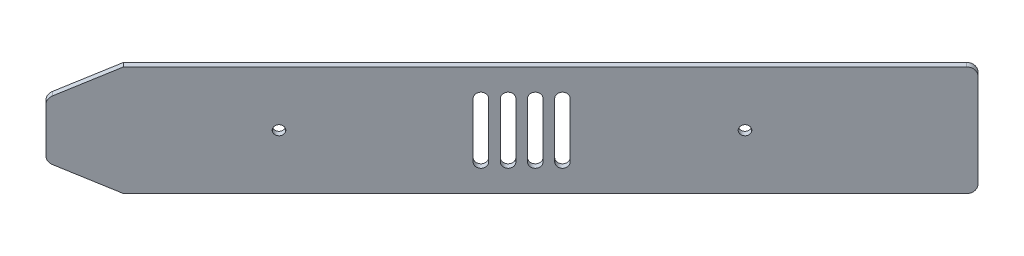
ISO-10303-21;
HEADER;
FILE_DESCRIPTION(('STEP AP214'),'2;1');
FILE_NAME('part.step','',(''),(''),'','','');
FILE_SCHEMA(('AUTOMOTIVE_DESIGN { 1 0 10303 214 1 1 1 1 }'));
ENDSEC;
DATA;
#1=APPLICATION_CONTEXT('core data for automotive mechanical design processes');
#2=APPLICATION_PROTOCOL_DEFINITION('international standard','automotive_design',2000,#1);
#3=PRODUCT_CONTEXT('',#1,'mechanical');
#4=PRODUCT('Part','Part','',(#3));
#5=PRODUCT_RELATED_PRODUCT_CATEGORY('part','',(#4));
#6=PRODUCT_DEFINITION_FORMATION('','',#4);
#7=PRODUCT_DEFINITION_CONTEXT('part definition',#1,'design');
#8=PRODUCT_DEFINITION('design','',#6,#7);
#9=PRODUCT_DEFINITION_SHAPE('','',#8);
#10=(LENGTH_UNIT() NAMED_UNIT(*) SI_UNIT(.MILLI.,.METRE.));
#11=(NAMED_UNIT(*) PLANE_ANGLE_UNIT() SI_UNIT($,.RADIAN.));
#12=(NAMED_UNIT(*) SI_UNIT($,.STERADIAN.) SOLID_ANGLE_UNIT());
#13=UNCERTAINTY_MEASURE_WITH_UNIT(LENGTH_MEASURE(1.E-05),#10,'distance_accuracy_value','');
#14=(GEOMETRIC_REPRESENTATION_CONTEXT(3) GLOBAL_UNCERTAINTY_ASSIGNED_CONTEXT((#13)) GLOBAL_UNIT_ASSIGNED_CONTEXT((#10,
#11,#12)) REPRESENTATION_CONTEXT('',''));
#15=CARTESIAN_POINT('',(0.,0.,0.));
#16=DIRECTION('',(0.,0.,1.));
#17=DIRECTION('',(1.,0.,0.));
#18=AXIS2_PLACEMENT_3D('',#15,#16,#17);
#19=CARTESIAN_POINT('',(26.6287521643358,39.9999999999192,15.8228234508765));
#20=DIRECTION('',(0.,-1.,0.));
#21=DIRECTION('',(-0.707106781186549,0.,-0.707106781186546));
#22=AXIS2_PLACEMENT_3D('',#19,#20,#21);
#23=PLANE('',#22);
#24=DIRECTION('',(-0.707106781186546,0.,0.707106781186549));
#25=VECTOR('',#24,1.);
#26=CARTESIAN_POINT('',(26.6287521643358,39.9999999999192,15.8228234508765));
#27=LINE('',#26,#25);
#28=CARTESIAN_POINT('',(180.070923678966,40.0000000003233,-137.619348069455));
#29=VERTEX_POINT('',#28);
#30=CARTESIAN_POINT('',(26.6287521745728,39.9999999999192,15.8228234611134));
#31=VERTEX_POINT('',#30);
#32=EDGE_CURVE('E218',#29,#31,#27,.T.);
#33=ORIENTED_EDGE('',*,*,#32,.F.);
#34=DIRECTION('',(-0.707106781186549,0.,-0.707106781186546));
#35=VECTOR('',#34,1.);
#36=CARTESIAN_POINT('',(180.070923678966,40.0000000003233,-137.619348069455));
#37=LINE('',#36,#35);
#38=CARTESIAN_POINT('',(178.656710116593,40.0000000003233,-139.033561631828));
#39=VERTEX_POINT('',#38);
#40=EDGE_CURVE('E419',#29,#39,#37,.T.);
#41=ORIENTED_EDGE('',*,*,#40,.T.);
#42=DIRECTION('',(-0.707106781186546,0.,0.707106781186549));
#43=VECTOR('',#42,1.);
#44=CARTESIAN_POINT('',(25.2145386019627,39.9999999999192,14.4086098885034));
#45=LINE('',#44,#43);
#46=CARTESIAN_POINT('',(25.2145386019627,39.9999999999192,14.4086098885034));
#47=VERTEX_POINT('',#46);
#48=EDGE_CURVE('E12',#39,#47,#45,.T.);
#49=ORIENTED_EDGE('',*,*,#48,.T.);
#50=DIRECTION('',(0.707106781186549,0.,0.707106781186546));
#51=VECTOR('',#50,1.);
#52=CARTESIAN_POINT('',(26.6287521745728,39.9999999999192,15.8228234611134));
#53=LINE('',#52,#51);
#54=EDGE_CURVE('E283',#47,#31,#53,.T.);
#55=ORIENTED_EDGE('',*,*,#54,.T.);
#56=EDGE_LOOP('',(#33,#41,#49,#55));
#57=FACE_BOUND('',#56,.T.);
#58=ADVANCED_FACE('F60',(#57),#23,.F.);
#59=CARTESIAN_POINT('',(13.1937233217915,28.1458980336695,26.4294251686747));
#60=DIRECTION('',(0.707106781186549,0.,0.707106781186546));
#61=DIRECTION('',(0.707106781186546,0.,-0.707106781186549));
#62=AXIS2_PLACEMENT_3D('',#59,#60,#61);
#63=PLANE('',#62);
#64=ORIENTED_EDGE('',*,*,#48,.F.);
#65=CARTESIAN_POINT('',(178.656710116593,37.0000000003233,-139.033561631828));
#66=DIRECTION('',(0.707106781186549,0.,0.707106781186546));
#67=DIRECTION('',(-0.707106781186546,0.,0.707106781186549));
#68=AXIS2_PLACEMENT_3D('',#65,#66,#67);
#69=CIRCLE('',#68,3.);
#70=CARTESIAN_POINT('',(180.778030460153,37.0000000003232,-141.154881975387));
#71=VERTEX_POINT('',#70);
#72=EDGE_CURVE('E286',#71,#39,#69,.T.);
#73=ORIENTED_EDGE('',*,*,#72,.F.);
#74=DIRECTION('',(0.,1.,0.));
#75=VECTOR('',#74,1.);
#76=CARTESIAN_POINT('',(180.778030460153,3.00000000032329,-141.154881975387));
#77=LINE('',#76,#75);
#78=CARTESIAN_POINT('',(180.778030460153,3.00000000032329,-141.154881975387));
#79=VERTEX_POINT('',#78);
#80=EDGE_CURVE('E199',#79,#71,#77,.T.);
#81=ORIENTED_EDGE('',*,*,#80,.F.);
#82=CARTESIAN_POINT('',(178.656710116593,3.00000000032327,-139.033561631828));
#83=DIRECTION('',(0.707106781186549,0.,0.707106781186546));
#84=DIRECTION('',(0.707106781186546,0.,-0.707106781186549));
#85=AXIS2_PLACEMENT_3D('',#82,#83,#84);
#86=CIRCLE('',#85,3.);
#87=CARTESIAN_POINT('',(178.656710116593,3.23265769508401E-10,-139.033561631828));
#88=VERTEX_POINT('',#87);
#89=EDGE_CURVE('E425',#88,#79,#86,.T.);
#90=ORIENTED_EDGE('',*,*,#89,.F.);
#91=DIRECTION('',(0.707106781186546,0.,-0.707106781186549));
#92=VECTOR('',#91,1.);
#93=CARTESIAN_POINT('',(25.2145386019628,-8.07687250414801E-11,14.4086098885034));
#94=LINE('',#93,#92);
#95=CARTESIAN_POINT('',(25.2145386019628,-8.07687250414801E-11,14.4086098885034));
#96=VERTEX_POINT('',#95);
#97=EDGE_CURVE('E70',#96,#88,#94,.T.);
#98=ORIENTED_EDGE('',*,*,#97,.F.);
#99=DIRECTION('',(0.632455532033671,-0.447213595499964,-0.632455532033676));
#100=VECTOR('',#99,1.);
#101=CARTESIAN_POINT('',(24.7323192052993,0.340980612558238,14.8908293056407));
#102=LINE('',#101,#100);
#103=CARTESIAN_POINT('',(12.2450400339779,9.17082039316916,27.3781084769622));
#104=VERTEX_POINT('',#103);
#105=EDGE_CURVE('E444',#104,#96,#102,.T.);
#106=ORIENTED_EDGE('',*,*,#105,.F.);
#107=CARTESIAN_POINT('',(13.1937233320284,11.8541019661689,26.4294251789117));
#108=DIRECTION('',(0.707106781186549,0.,0.707106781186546));
#109=DIRECTION('',(-0.707106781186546,0.,0.707106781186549));
#110=AXIS2_PLACEMENT_3D('',#107,#108,#109);
#111=CIRCLE('',#110,3.);
#112=CARTESIAN_POINT('',(11.0724029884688,11.8541019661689,28.5507455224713));
#113=VERTEX_POINT('',#112);
#114=EDGE_CURVE('E256',#113,#104,#111,.T.);
#115=ORIENTED_EDGE('',*,*,#114,.F.);
#116=DIRECTION('',(0.,-1.,0.));
#117=VECTOR('',#116,1.);
#118=CARTESIAN_POINT('',(11.0724029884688,11.8541019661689,28.5507455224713));
#119=LINE('',#118,#117);
#120=CARTESIAN_POINT('',(11.0724029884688,28.1458980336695,28.5507455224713));
#121=VERTEX_POINT('',#120);
#122=EDGE_CURVE('E249',#121,#113,#119,.T.);
#123=ORIENTED_EDGE('',*,*,#122,.F.);
#124=CARTESIAN_POINT('',(13.1937233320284,28.1458980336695,26.4294251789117));
#125=DIRECTION('',(0.707106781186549,0.,0.707106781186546));
#126=DIRECTION('',(0.707106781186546,0.,-0.707106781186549));
#127=AXIS2_PLACEMENT_3D('',#124,#125,#126);
#128=CIRCLE('',#127,3.);
#129=CARTESIAN_POINT('',(12.2450400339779,30.8291796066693,27.3781084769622));
#130=VERTEX_POINT('',#129);
#131=EDGE_CURVE('E254',#130,#121,#128,.T.);
#132=ORIENTED_EDGE('',*,*,#131,.F.);
#133=DIRECTION('',(-0.632455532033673,-0.447213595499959,0.632455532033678));
#134=VECTOR('',#133,1.);
#135=CARTESIAN_POINT('',(25.2145386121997,39.9999999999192,14.4086098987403));
#136=LINE('',#135,#134);
#137=EDGE_CURVE('E447',#47,#130,#136,.T.);
#138=ORIENTED_EDGE('',*,*,#137,.F.);
#139=EDGE_LOOP('',(#64,#73,#81,#90,#98,#106,#115,#123,#132,#138));
#140=FACE_BOUND('',#139,.T.);
#141=CARTESIAN_POINT('',(138.35162358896,20.,-98.7284751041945));
#142=DIRECTION('',(0.707106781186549,0.,0.707106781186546));
#143=DIRECTION('',(0.707106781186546,0.,-0.707106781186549));
#144=AXIS2_PLACEMENT_3D('',#141,#142,#143);
#145=CIRCLE('',#144,1.75000000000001);
#146=CARTESIAN_POINT('',(139.589060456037,20.,-99.9659119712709));
#147=VERTEX_POINT('',#146);
#148=EDGE_CURVE('E290',#147,#147,#145,.T.);
#149=ORIENTED_EDGE('',*,*,#148,.T.);
#150=EDGE_LOOP('',(#149));
#151=FACE_BOUND('',#150,.T.);
#152=CARTESIAN_POINT('',(53.4988098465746,20.,-13.8756613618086));
#153=DIRECTION('',(0.707106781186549,0.,0.707106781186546));
#154=DIRECTION('',(0.707106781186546,0.,-0.707106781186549));
#155=AXIS2_PLACEMENT_3D('',#152,#153,#154);
#156=CIRCLE('',#155,1.75);
#157=CARTESIAN_POINT('',(54.736246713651,20.,-15.1130982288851));
#158=VERTEX_POINT('',#157);
#159=EDGE_CURVE('E287',#158,#158,#156,.T.);
#160=ORIENTED_EDGE('',*,*,#159,.T.);
#161=EDGE_LOOP('',(#160));
#162=FACE_BOUND('',#161,.T.);
#163=DIRECTION('',(0.,-1.,0.));
#164=VECTOR('',#163,1.);
#165=CARTESIAN_POINT('',(106.531818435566,30.,-66.9086699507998));
#166=LINE('',#165,#164);
#167=CARTESIAN_POINT('',(106.531818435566,30.,-66.9086699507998));
#168=VERTEX_POINT('',#167);
#169=CARTESIAN_POINT('',(106.531818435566,10.,-66.9086699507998));
#170=VERTEX_POINT('',#169);
#171=EDGE_CURVE('E384',#168,#170,#166,.T.);
#172=ORIENTED_EDGE('',*,*,#171,.F.);
#173=CARTESIAN_POINT('',(105.117604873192,30.,-65.4944563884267));
#174=DIRECTION('',(-0.707106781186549,0.,-0.707106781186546));
#175=DIRECTION('',(0.707106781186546,0.,-0.707106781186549));
#176=AXIS2_PLACEMENT_3D('',#173,#174,#175);
#177=CIRCLE('',#176,2.);
#178=CARTESIAN_POINT('',(103.703391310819,30.,-64.0802428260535));
#179=VERTEX_POINT('',#178);
#180=EDGE_CURVE('E378',#179,#168,#177,.T.);
#181=ORIENTED_EDGE('',*,*,#180,.F.);
#182=DIRECTION('',(0.,1.,0.));
#183=VECTOR('',#182,1.);
#184=CARTESIAN_POINT('',(103.703391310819,30.,-64.0802428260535));
#185=LINE('',#184,#183);
#186=CARTESIAN_POINT('',(103.703391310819,10.,-64.0802428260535));
#187=VERTEX_POINT('',#186);
#188=EDGE_CURVE('E400',#187,#179,#185,.T.);
#189=ORIENTED_EDGE('',*,*,#188,.F.);
#190=CARTESIAN_POINT('',(105.117604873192,10.,-65.4944563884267));
#191=DIRECTION('',(-0.707106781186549,0.,-0.707106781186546));
#192=DIRECTION('',(0.707106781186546,0.,-0.707106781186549));
#193=AXIS2_PLACEMENT_3D('',#190,#191,#192);
#194=CIRCLE('',#193,2.);
#195=EDGE_CURVE('E392',#170,#187,#194,.T.);
#196=ORIENTED_EDGE('',*,*,#195,.F.);
#197=EDGE_LOOP('',(#172,#181,#189,#196));
#198=FACE_BOUND('',#197,.T.);
#199=DIRECTION('',(0.,-1.,0.));
#200=VECTOR('',#199,1.);
#201=CARTESIAN_POINT('',(101.58207096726,30.,-61.9589224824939));
#202=LINE('',#201,#200);
#203=CARTESIAN_POINT('',(101.58207096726,30.,-61.9589224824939));
#204=VERTEX_POINT('',#203);
#205=CARTESIAN_POINT('',(101.58207096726,10.,-61.9589224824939));
#206=VERTEX_POINT('',#205);
#207=EDGE_CURVE('E355',#204,#206,#202,.T.);
#208=ORIENTED_EDGE('',*,*,#207,.F.);
#209=CARTESIAN_POINT('',(100.167857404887,30.,-60.5447089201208));
#210=DIRECTION('',(-0.707106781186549,0.,-0.707106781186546));
#211=DIRECTION('',(0.707106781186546,0.,-0.707106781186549));
#212=AXIS2_PLACEMENT_3D('',#209,#210,#211);
#213=CIRCLE('',#212,2.);
#214=CARTESIAN_POINT('',(98.7536438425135,30.,-59.1304953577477));
#215=VERTEX_POINT('',#214);
#216=EDGE_CURVE('E349',#215,#204,#213,.T.);
#217=ORIENTED_EDGE('',*,*,#216,.F.);
#218=DIRECTION('',(0.,1.,0.));
#219=VECTOR('',#218,1.);
#220=CARTESIAN_POINT('',(98.7536438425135,30.,-59.1304953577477));
#221=LINE('',#220,#219);
#222=CARTESIAN_POINT('',(98.7536438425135,10.,-59.1304953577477));
#223=VERTEX_POINT('',#222);
#224=EDGE_CURVE('E371',#223,#215,#221,.T.);
#225=ORIENTED_EDGE('',*,*,#224,.F.);
#226=CARTESIAN_POINT('',(100.167857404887,10.,-60.5447089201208));
#227=DIRECTION('',(-0.707106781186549,0.,-0.707106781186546));
#228=DIRECTION('',(0.707106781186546,0.,-0.707106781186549));
#229=AXIS2_PLACEMENT_3D('',#226,#227,#228);
#230=CIRCLE('',#229,2.);
#231=EDGE_CURVE('E363',#206,#223,#230,.T.);
#232=ORIENTED_EDGE('',*,*,#231,.F.);
#233=EDGE_LOOP('',(#208,#217,#225,#232));
#234=FACE_BOUND('',#233,.T.);
#235=DIRECTION('',(0.,-1.,0.));
#236=VECTOR('',#235,1.);
#237=CARTESIAN_POINT('',(96.6323234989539,30.,-57.0091750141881));
#238=LINE('',#237,#236);
#239=CARTESIAN_POINT('',(96.6323234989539,30.,-57.0091750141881));
#240=VERTEX_POINT('',#239);
#241=CARTESIAN_POINT('',(96.6323234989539,10.,-57.0091750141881));
#242=VERTEX_POINT('',#241);
#243=EDGE_CURVE('E326',#240,#242,#238,.T.);
#244=ORIENTED_EDGE('',*,*,#243,.F.);
#245=CARTESIAN_POINT('',(95.2181099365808,30.,-55.594961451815));
#246=DIRECTION('',(-0.707106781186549,0.,-0.707106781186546));
#247=DIRECTION('',(0.707106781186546,0.,-0.707106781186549));
#248=AXIS2_PLACEMENT_3D('',#245,#246,#247);
#249=CIRCLE('',#248,2.);
#250=CARTESIAN_POINT('',(93.8038963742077,30.,-54.1807478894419));
#251=VERTEX_POINT('',#250);
#252=EDGE_CURVE('E320',#251,#240,#249,.T.);
#253=ORIENTED_EDGE('',*,*,#252,.F.);
#254=DIRECTION('',(0.,1.,0.));
#255=VECTOR('',#254,1.);
#256=CARTESIAN_POINT('',(93.8038963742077,30.,-54.1807478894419));
#257=LINE('',#256,#255);
#258=CARTESIAN_POINT('',(93.8038963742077,10.,-54.1807478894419));
#259=VERTEX_POINT('',#258);
#260=EDGE_CURVE('E342',#259,#251,#257,.T.);
#261=ORIENTED_EDGE('',*,*,#260,.F.);
#262=CARTESIAN_POINT('',(95.2181099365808,10.,-55.594961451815));
#263=DIRECTION('',(-0.707106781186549,0.,-0.707106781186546));
#264=DIRECTION('',(0.707106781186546,0.,-0.707106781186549));
#265=AXIS2_PLACEMENT_3D('',#262,#263,#264);
#266=CIRCLE('',#265,2.);
#267=EDGE_CURVE('E334',#242,#259,#266,.T.);
#268=ORIENTED_EDGE('',*,*,#267,.F.);
#269=EDGE_LOOP('',(#244,#253,#261,#268));
#270=FACE_BOUND('',#269,.T.);
#271=DIRECTION('',(0.,-1.,0.));
#272=VECTOR('',#271,1.);
#273=CARTESIAN_POINT('',(91.682576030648,30.,-52.0594275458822));
#274=LINE('',#273,#272);
#275=CARTESIAN_POINT('',(91.682576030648,30.,-52.0594275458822));
#276=VERTEX_POINT('',#275);
#277=CARTESIAN_POINT('',(91.682576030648,10.,-52.0594275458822));
#278=VERTEX_POINT('',#277);
#279=EDGE_CURVE('E298',#276,#278,#274,.T.);
#280=ORIENTED_EDGE('',*,*,#279,.F.);
#281=CARTESIAN_POINT('',(90.2683624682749,30.,-50.6452139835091));
#282=DIRECTION('',(-0.707106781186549,0.,-0.707106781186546));
#283=DIRECTION('',(0.707106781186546,0.,-0.707106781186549));
#284=AXIS2_PLACEMENT_3D('',#281,#282,#283);
#285=CIRCLE('',#284,2.);
#286=CARTESIAN_POINT('',(88.8541489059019,30.,-49.231000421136));
#287=VERTEX_POINT('',#286);
#288=EDGE_CURVE('E79',#287,#276,#285,.T.);
#289=ORIENTED_EDGE('',*,*,#288,.F.);
#290=DIRECTION('',(0.,1.,0.));
#291=VECTOR('',#290,1.);
#292=CARTESIAN_POINT('',(88.8541489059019,30.,-49.231000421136));
#293=LINE('',#292,#291);
#294=CARTESIAN_POINT('',(88.8541489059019,10.,-49.231000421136));
#295=VERTEX_POINT('',#294);
#296=EDGE_CURVE('E313',#295,#287,#293,.T.);
#297=ORIENTED_EDGE('',*,*,#296,.F.);
#298=CARTESIAN_POINT('',(90.2683624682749,10.,-50.6452139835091));
#299=DIRECTION('',(-0.707106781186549,0.,-0.707106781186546));
#300=DIRECTION('',(0.707106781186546,0.,-0.707106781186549));
#301=AXIS2_PLACEMENT_3D('',#298,#299,#300);
#302=CIRCLE('',#301,2.);
#303=EDGE_CURVE('E305',#278,#295,#302,.T.);
#304=ORIENTED_EDGE('',*,*,#303,.F.);
#305=EDGE_LOOP('',(#280,#289,#297,#304));
#306=FACE_BOUND('',#305,.T.);
#307=ADVANCED_FACE('F251',(#140,#151,#162,#198,#234,#270,#306),#63,.F.);
#308=CARTESIAN_POINT('',(26.6287521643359,-8.07687250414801E-11,15.8228234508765));
#309=DIRECTION('',(0.,1.,0.));
#310=DIRECTION('',(0.707106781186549,0.,0.707106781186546));
#311=AXIS2_PLACEMENT_3D('',#308,#309,#310);
#312=PLANE('',#311);
#313=ORIENTED_EDGE('',*,*,#97,.T.);
#314=DIRECTION('',(-0.707106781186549,0.,-0.707106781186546));
#315=VECTOR('',#314,1.);
#316=CARTESIAN_POINT('',(180.070923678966,3.23265769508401E-10,-137.619348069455));
#317=LINE('',#316,#315);
#318=CARTESIAN_POINT('',(180.070923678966,3.23265769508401E-10,-137.619348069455));
#319=VERTEX_POINT('',#318);
#320=EDGE_CURVE('E422',#319,#88,#317,.T.);
#321=ORIENTED_EDGE('',*,*,#320,.F.);
#322=DIRECTION('',(0.707106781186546,0.,-0.707106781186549));
#323=VECTOR('',#322,1.);
#324=CARTESIAN_POINT('',(26.6287521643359,-8.07687250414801E-11,15.8228234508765));
#325=LINE('',#324,#323);
#326=CARTESIAN_POINT('',(26.6287521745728,-8.07687250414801E-11,15.8228234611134));
#327=VERTEX_POINT('',#326);
#328=EDGE_CURVE('E211',#327,#319,#325,.T.);
#329=ORIENTED_EDGE('',*,*,#328,.F.);
#330=DIRECTION('',(0.707106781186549,0.,0.707106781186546));
#331=VECTOR('',#330,1.);
#332=CARTESIAN_POINT('',(26.6287521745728,-8.07687250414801E-11,15.8228234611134));
#333=LINE('',#332,#331);
#334=EDGE_CURVE('E281',#96,#327,#333,.T.);
#335=ORIENTED_EDGE('',*,*,#334,.F.);
#336=EDGE_LOOP('',(#313,#321,#329,#335));
#337=FACE_BOUND('',#336,.T.);
#338=ADVANCED_FACE('F481',(#337),#312,.F.);
#339=CARTESIAN_POINT('',(14.6079368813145,28.1458980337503,27.8436387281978));
#340=DIRECTION('',(0.707106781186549,0.,0.707106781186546));
#341=DIRECTION('',(0.707106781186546,0.,-0.707106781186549));
#342=AXIS2_PLACEMENT_3D('',#339,#340,#341);
#343=PLANE('',#342);
#344=ORIENTED_EDGE('',*,*,#328,.T.);
#345=CARTESIAN_POINT('',(180.070923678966,3.00000000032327,-137.619348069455));
#346=DIRECTION('',(0.707106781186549,0.,0.707106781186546));
#347=DIRECTION('',(0.707106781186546,0.,-0.707106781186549));
#348=AXIS2_PLACEMENT_3D('',#345,#346,#347);
#349=CIRCLE('',#348,3.);
#350=CARTESIAN_POINT('',(182.192244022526,3.00000000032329,-139.740668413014));
#351=VERTEX_POINT('',#350);
#352=EDGE_CURVE('E417',#319,#351,#349,.T.);
#353=ORIENTED_EDGE('',*,*,#352,.T.);
#354=DIRECTION('',(0.,1.,0.));
#355=VECTOR('',#354,1.);
#356=CARTESIAN_POINT('',(182.192244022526,3.00000000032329,-139.740668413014));
#357=LINE('',#356,#355);
#358=CARTESIAN_POINT('',(182.192244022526,37.0000000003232,-139.740668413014));
#359=VERTEX_POINT('',#358);
#360=EDGE_CURVE('E415',#351,#359,#357,.T.);
#361=ORIENTED_EDGE('',*,*,#360,.T.);
#362=CARTESIAN_POINT('',(180.070923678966,37.0000000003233,-137.619348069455));
#363=DIRECTION('',(0.707106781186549,0.,0.707106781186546));
#364=DIRECTION('',(-0.707106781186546,0.,0.707106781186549));
#365=AXIS2_PLACEMENT_3D('',#362,#363,#364);
#366=CIRCLE('',#365,3.);
#367=EDGE_CURVE('E413',#359,#29,#366,.T.);
#368=ORIENTED_EDGE('',*,*,#367,.T.);
#369=ORIENTED_EDGE('',*,*,#32,.T.);
#370=DIRECTION('',(-0.632455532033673,-0.447213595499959,0.632455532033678));
#371=VECTOR('',#370,1.);
#372=CARTESIAN_POINT('',(26.6287521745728,39.9999999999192,15.8228234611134));
#373=LINE('',#372,#371);
#374=CARTESIAN_POINT('',(13.659253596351,30.8291796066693,28.7923220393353));
#375=VERTEX_POINT('',#374);
#376=EDGE_CURVE('E439',#31,#375,#373,.T.);
#377=ORIENTED_EDGE('',*,*,#376,.T.);
#378=CARTESIAN_POINT('',(14.6079368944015,28.1458980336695,27.8436387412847));
#379=DIRECTION('',(0.707106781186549,0.,0.707106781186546));
#380=DIRECTION('',(0.707106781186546,0.,-0.707106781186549));
#381=AXIS2_PLACEMENT_3D('',#378,#379,#380);
#382=CIRCLE('',#381,3.);
#383=CARTESIAN_POINT('',(12.4866165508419,28.1458980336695,29.9649590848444));
#384=VERTEX_POINT('',#383);
#385=EDGE_CURVE('E275',#375,#384,#382,.T.);
#386=ORIENTED_EDGE('',*,*,#385,.T.);
#387=DIRECTION('',(0.,-1.,0.));
#388=VECTOR('',#387,1.);
#389=CARTESIAN_POINT('',(12.4866165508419,11.8541019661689,29.9649590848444));
#390=LINE('',#389,#388);
#391=CARTESIAN_POINT('',(12.4866165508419,11.8541019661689,29.9649590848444));
#392=VERTEX_POINT('',#391);
#393=EDGE_CURVE('E265',#384,#392,#390,.T.);
#394=ORIENTED_EDGE('',*,*,#393,.T.);
#395=CARTESIAN_POINT('',(14.6079368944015,11.8541019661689,27.8436387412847));
#396=DIRECTION('',(0.707106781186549,0.,0.707106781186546));
#397=DIRECTION('',(-0.707106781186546,0.,0.707106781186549));
#398=AXIS2_PLACEMENT_3D('',#395,#396,#397);
#399=CIRCLE('',#398,3.);
#400=CARTESIAN_POINT('',(13.659253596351,9.17082039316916,28.7923220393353));
#401=VERTEX_POINT('',#400);
#402=EDGE_CURVE('E461',#392,#401,#399,.T.);
#403=ORIENTED_EDGE('',*,*,#402,.T.);
#404=DIRECTION('',(0.632455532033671,-0.447213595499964,-0.632455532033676));
#405=VECTOR('',#404,1.);
#406=CARTESIAN_POINT('',(26.1465327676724,0.340980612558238,16.3050428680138));
#407=LINE('',#406,#405);
#408=EDGE_CURVE('E284',#401,#327,#407,.T.);
#409=ORIENTED_EDGE('',*,*,#408,.T.);
#410=EDGE_LOOP('',(#344,#353,#361,#368,#369,#377,#386,#394,#403,#409));
#411=FACE_BOUND('',#410,.T.);
#412=CARTESIAN_POINT('',(91.682576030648,30.,-49.231000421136));
#413=DIRECTION('',(0.707106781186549,0.,0.707106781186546));
#414=DIRECTION('',(0.707106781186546,0.,-0.707106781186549));
#415=AXIS2_PLACEMENT_3D('',#412,#413,#414);
#416=CIRCLE('',#415,2.);
#417=CARTESIAN_POINT('',(93.0967895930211,30.,-50.6452139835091));
#418=VERTEX_POINT('',#417);
#419=CARTESIAN_POINT('',(90.268362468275,30.,-47.8167868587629));
#420=VERTEX_POINT('',#419);
#421=EDGE_CURVE('E296',#418,#420,#416,.T.);
#422=ORIENTED_EDGE('',*,*,#421,.F.);
#423=DIRECTION('',(0.,1.,0.));
#424=VECTOR('',#423,1.);
#425=CARTESIAN_POINT('',(93.0967895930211,28.1458980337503,-50.6452139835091));
#426=LINE('',#425,#424);
#427=CARTESIAN_POINT('',(93.0967895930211,10.,-50.6452139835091));
#428=VERTEX_POINT('',#427);
#429=EDGE_CURVE('E303',#428,#418,#426,.T.);
#430=ORIENTED_EDGE('',*,*,#429,.F.);
#431=CARTESIAN_POINT('',(91.682576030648,10.,-49.231000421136));
#432=DIRECTION('',(0.707106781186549,0.,0.707106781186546));
#433=DIRECTION('',(0.707106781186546,0.,-0.707106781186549));
#434=AXIS2_PLACEMENT_3D('',#431,#432,#433);
#435=CIRCLE('',#434,2.);
#436=CARTESIAN_POINT('',(90.268362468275,10.,-47.8167868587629));
#437=VERTEX_POINT('',#436);
#438=EDGE_CURVE('E310',#437,#428,#435,.T.);
#439=ORIENTED_EDGE('',*,*,#438,.F.);
#440=DIRECTION('',(0.,-1.,0.));
#441=VECTOR('',#440,1.);
#442=CARTESIAN_POINT('',(90.268362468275,28.1458980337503,-47.8167868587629));
#443=LINE('',#442,#441);
#444=EDGE_CURVE('E318',#420,#437,#443,.T.);
#445=ORIENTED_EDGE('',*,*,#444,.F.);
#446=EDGE_LOOP('',(#422,#430,#439,#445));
#447=FACE_BOUND('',#446,.T.);
#448=CARTESIAN_POINT('',(96.6323234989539,30.,-54.1807478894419));
#449=DIRECTION('',(0.707106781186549,0.,0.707106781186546));
#450=DIRECTION('',(0.707106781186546,0.,-0.707106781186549));
#451=AXIS2_PLACEMENT_3D('',#448,#449,#450);
#452=CIRCLE('',#451,2.);
#453=CARTESIAN_POINT('',(98.046537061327,30.,-55.594961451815));
#454=VERTEX_POINT('',#453);
#455=CARTESIAN_POINT('',(95.2181099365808,30.,-52.7665343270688));
#456=VERTEX_POINT('',#455);
#457=EDGE_CURVE('E324',#454,#456,#452,.T.);
#458=ORIENTED_EDGE('',*,*,#457,.F.);
#459=DIRECTION('',(0.,1.,0.));
#460=VECTOR('',#459,1.);
#461=CARTESIAN_POINT('',(98.046537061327,28.1458980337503,-55.594961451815));
#462=LINE('',#461,#460);
#463=CARTESIAN_POINT('',(98.046537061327,10.,-55.594961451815));
#464=VERTEX_POINT('',#463);
#465=EDGE_CURVE('E332',#464,#454,#462,.T.);
#466=ORIENTED_EDGE('',*,*,#465,.F.);
#467=CARTESIAN_POINT('',(96.6323234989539,10.,-54.1807478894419));
#468=DIRECTION('',(0.707106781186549,0.,0.707106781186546));
#469=DIRECTION('',(0.707106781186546,0.,-0.707106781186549));
#470=AXIS2_PLACEMENT_3D('',#467,#468,#469);
#471=CIRCLE('',#470,2.);
#472=CARTESIAN_POINT('',(95.2181099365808,10.,-52.7665343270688));
#473=VERTEX_POINT('',#472);
#474=EDGE_CURVE('E339',#473,#464,#471,.T.);
#475=ORIENTED_EDGE('',*,*,#474,.F.);
#476=DIRECTION('',(0.,-1.,0.));
#477=VECTOR('',#476,1.);
#478=CARTESIAN_POINT('',(95.2181099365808,28.1458980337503,-52.7665343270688));
#479=LINE('',#478,#477);
#480=EDGE_CURVE('E347',#456,#473,#479,.T.);
#481=ORIENTED_EDGE('',*,*,#480,.F.);
#482=EDGE_LOOP('',(#458,#466,#475,#481));
#483=FACE_BOUND('',#482,.T.);
#484=CARTESIAN_POINT('',(101.58207096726,30.,-59.1304953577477));
#485=DIRECTION('',(0.707106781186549,0.,0.707106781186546));
#486=DIRECTION('',(0.707106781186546,0.,-0.707106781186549));
#487=AXIS2_PLACEMENT_3D('',#484,#485,#486);
#488=CIRCLE('',#487,2.);
#489=CARTESIAN_POINT('',(102.996284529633,30.,-60.5447089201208));
#490=VERTEX_POINT('',#489);
#491=CARTESIAN_POINT('',(100.167857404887,30.,-57.7162817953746));
#492=VERTEX_POINT('',#491);
#493=EDGE_CURVE('E353',#490,#492,#488,.T.);
#494=ORIENTED_EDGE('',*,*,#493,.F.);
#495=DIRECTION('',(0.,1.,0.));
#496=VECTOR('',#495,1.);
#497=CARTESIAN_POINT('',(102.996284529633,28.1458980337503,-60.5447089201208));
#498=LINE('',#497,#496);
#499=CARTESIAN_POINT('',(102.996284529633,10.,-60.5447089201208));
#500=VERTEX_POINT('',#499);
#501=EDGE_CURVE('E361',#500,#490,#498,.T.);
#502=ORIENTED_EDGE('',*,*,#501,.F.);
#503=CARTESIAN_POINT('',(101.58207096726,10.,-59.1304953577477));
#504=DIRECTION('',(0.707106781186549,0.,0.707106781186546));
#505=DIRECTION('',(0.707106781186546,0.,-0.707106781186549));
#506=AXIS2_PLACEMENT_3D('',#503,#504,#505);
#507=CIRCLE('',#506,2.);
#508=CARTESIAN_POINT('',(100.167857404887,10.,-57.7162817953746));
#509=VERTEX_POINT('',#508);
#510=EDGE_CURVE('E368',#509,#500,#507,.T.);
#511=ORIENTED_EDGE('',*,*,#510,.F.);
#512=DIRECTION('',(0.,-1.,0.));
#513=VECTOR('',#512,1.);
#514=CARTESIAN_POINT('',(100.167857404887,28.1458980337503,-57.7162817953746));
#515=LINE('',#514,#513);
#516=EDGE_CURVE('E376',#492,#509,#515,.T.);
#517=ORIENTED_EDGE('',*,*,#516,.F.);
#518=EDGE_LOOP('',(#494,#502,#511,#517));
#519=FACE_BOUND('',#518,.T.);
#520=CARTESIAN_POINT('',(106.531818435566,30.,-64.0802428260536));
#521=DIRECTION('',(0.707106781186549,0.,0.707106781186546));
#522=DIRECTION('',(0.707106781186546,0.,-0.707106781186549));
#523=AXIS2_PLACEMENT_3D('',#520,#521,#522);
#524=CIRCLE('',#523,2.);
#525=CARTESIAN_POINT('',(107.946031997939,30.,-65.4944563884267));
#526=VERTEX_POINT('',#525);
#527=CARTESIAN_POINT('',(105.117604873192,30.,-62.6660292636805));
#528=VERTEX_POINT('',#527);
#529=EDGE_CURVE('E382',#526,#528,#524,.T.);
#530=ORIENTED_EDGE('',*,*,#529,.F.);
#531=DIRECTION('',(0.,1.,0.));
#532=VECTOR('',#531,1.);
#533=CARTESIAN_POINT('',(107.946031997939,28.1458980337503,-65.4944563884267));
#534=LINE('',#533,#532);
#535=CARTESIAN_POINT('',(107.946031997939,10.,-65.4944563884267));
#536=VERTEX_POINT('',#535);
#537=EDGE_CURVE('E390',#536,#526,#534,.T.);
#538=ORIENTED_EDGE('',*,*,#537,.F.);
#539=CARTESIAN_POINT('',(106.531818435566,10.,-64.0802428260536));
#540=DIRECTION('',(0.707106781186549,0.,0.707106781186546));
#541=DIRECTION('',(0.707106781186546,0.,-0.707106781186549));
#542=AXIS2_PLACEMENT_3D('',#539,#540,#541);
#543=CIRCLE('',#542,2.);
#544=CARTESIAN_POINT('',(105.117604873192,10.,-62.6660292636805));
#545=VERTEX_POINT('',#544);
#546=EDGE_CURVE('E397',#545,#536,#543,.T.);
#547=ORIENTED_EDGE('',*,*,#546,.F.);
#548=DIRECTION('',(0.,-1.,0.));
#549=VECTOR('',#548,1.);
#550=CARTESIAN_POINT('',(105.117604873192,28.1458980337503,-62.6660292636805));
#551=LINE('',#550,#549);
#552=EDGE_CURVE('E405',#528,#545,#551,.T.);
#553=ORIENTED_EDGE('',*,*,#552,.F.);
#554=EDGE_LOOP('',(#530,#538,#547,#553));
#555=FACE_BOUND('',#554,.T.);
#556=CARTESIAN_POINT('',(54.9130234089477,20.,-12.4614477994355));
#557=DIRECTION('',(0.707106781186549,0.,0.707106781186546));
#558=DIRECTION('',(0.707106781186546,0.,-0.707106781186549));
#559=AXIS2_PLACEMENT_3D('',#556,#557,#558);
#560=CIRCLE('',#559,1.75);
#561=CARTESIAN_POINT('',(56.1504602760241,20.,-13.698884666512));
#562=VERTEX_POINT('',#561);
#563=EDGE_CURVE('E407',#562,#562,#560,.T.);
#564=ORIENTED_EDGE('',*,*,#563,.F.);
#565=EDGE_LOOP('',(#564));
#566=FACE_BOUND('',#565,.T.);
#567=CARTESIAN_POINT('',(139.765837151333,20.,-97.3142615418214));
#568=DIRECTION('',(0.707106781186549,0.,0.707106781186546));
#569=DIRECTION('',(0.707106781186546,0.,-0.707106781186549));
#570=AXIS2_PLACEMENT_3D('',#567,#568,#569);
#571=CIRCLE('',#570,1.75000000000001);
#572=CARTESIAN_POINT('',(141.00327401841,20.,-98.5516984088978));
#573=VERTEX_POINT('',#572);
#574=EDGE_CURVE('E410',#573,#573,#571,.T.);
#575=ORIENTED_EDGE('',*,*,#574,.F.);
#576=EDGE_LOOP('',(#575));
#577=FACE_BOUND('',#576,.T.);
#578=ADVANCED_FACE('F62',(#411,#447,#483,#519,#555,#566,#577),#343,.T.);
#579=CARTESIAN_POINT('',(180.070923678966,37.0000000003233,-137.619348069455));
#580=DIRECTION('',(-0.707106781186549,0.,-0.707106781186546));
#581=DIRECTION('',(-0.707106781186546,0.,0.707106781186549));
#582=AXIS2_PLACEMENT_3D('',#579,#580,#581);
#583=CYLINDRICAL_SURFACE('',#582,3.);
#584=ORIENTED_EDGE('',*,*,#72,.T.);
#585=ORIENTED_EDGE('',*,*,#40,.F.);
#586=ORIENTED_EDGE('',*,*,#367,.F.);
#587=DIRECTION('',(-0.707106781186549,0.,-0.707106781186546));
#588=VECTOR('',#587,1.);
#589=CARTESIAN_POINT('',(182.192244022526,37.0000000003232,-139.740668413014));
#590=LINE('',#589,#588);
#591=EDGE_CURVE('E430',#359,#71,#590,.T.);
#592=ORIENTED_EDGE('',*,*,#591,.T.);
#593=EDGE_LOOP('',(#584,#585,#586,#592));
#594=FACE_BOUND('',#593,.T.);
#595=ADVANCED_FACE('F474',(#594),#583,.T.);
#596=CARTESIAN_POINT('',(182.192244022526,3.00000000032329,-139.740668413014));
#597=DIRECTION('',(-0.707106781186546,0.,0.707106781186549));
#598=DIRECTION('',(0.707106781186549,0.,0.707106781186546));
#599=AXIS2_PLACEMENT_3D('',#596,#597,#598);
#600=PLANE('',#599);
#601=ORIENTED_EDGE('',*,*,#80,.T.);
#602=ORIENTED_EDGE('',*,*,#591,.F.);
#603=ORIENTED_EDGE('',*,*,#360,.F.);
#604=DIRECTION('',(-0.707106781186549,0.,-0.707106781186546));
#605=VECTOR('',#604,1.);
#606=CARTESIAN_POINT('',(182.192244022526,3.00000000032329,-139.740668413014));
#607=LINE('',#606,#605);
#608=EDGE_CURVE('E427',#351,#79,#607,.T.);
#609=ORIENTED_EDGE('',*,*,#608,.T.);
#610=EDGE_LOOP('',(#601,#602,#603,#609));
#611=FACE_BOUND('',#610,.T.);
#612=ADVANCED_FACE('F480',(#611),#600,.F.);
#613=CARTESIAN_POINT('',(180.070923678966,3.00000000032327,-137.619348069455));
#614=DIRECTION('',(-0.707106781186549,0.,-0.707106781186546));
#615=DIRECTION('',(-0.707106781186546,0.,0.707106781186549));
#616=AXIS2_PLACEMENT_3D('',#613,#614,#615);
#617=CYLINDRICAL_SURFACE('',#616,3.);
#618=ORIENTED_EDGE('',*,*,#89,.T.);
#619=ORIENTED_EDGE('',*,*,#608,.F.);
#620=ORIENTED_EDGE('',*,*,#352,.F.);
#621=ORIENTED_EDGE('',*,*,#320,.T.);
#622=EDGE_LOOP('',(#618,#619,#620,#621));
#623=FACE_BOUND('',#622,.T.);
#624=ADVANCED_FACE('F477',(#623),#617,.T.);
#625=CARTESIAN_POINT('',(139.765837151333,20.,-97.3142615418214));
#626=DIRECTION('',(-0.707106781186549,0.,-0.707106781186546));
#627=DIRECTION('',(-0.707106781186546,0.,0.707106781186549));
#628=AXIS2_PLACEMENT_3D('',#625,#626,#627);
#629=CYLINDRICAL_SURFACE('',#628,1.75000000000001);
#630=ORIENTED_EDGE('',*,*,#574,.T.);
#631=EDGE_LOOP('',(#630));
#632=FACE_BOUND('',#631,.T.);
#633=ORIENTED_EDGE('',*,*,#148,.F.);
#634=EDGE_LOOP('',(#633));
#635=FACE_BOUND('',#634,.T.);
#636=ADVANCED_FACE('F535',(#632,#635),#629,.F.);
#637=CARTESIAN_POINT('',(54.9130234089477,20.,-12.4614477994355));
#638=DIRECTION('',(-0.707106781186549,0.,-0.707106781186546));
#639=DIRECTION('',(-0.707106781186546,0.,0.707106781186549));
#640=AXIS2_PLACEMENT_3D('',#637,#638,#639);
#641=CYLINDRICAL_SURFACE('',#640,1.75);
#642=ORIENTED_EDGE('',*,*,#563,.T.);
#643=EDGE_LOOP('',(#642));
#644=FACE_BOUND('',#643,.T.);
#645=ORIENTED_EDGE('',*,*,#159,.F.);
#646=EDGE_LOOP('',(#645));
#647=FACE_BOUND('',#646,.T.);
#648=ADVANCED_FACE('F542',(#644,#647),#641,.F.);
#649=CARTESIAN_POINT('',(110.774459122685,30.,-57.0091750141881));
#650=DIRECTION('',(-0.707106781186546,0.,0.707106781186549));
#651=DIRECTION('',(0.707106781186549,0.,0.707106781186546));
#652=AXIS2_PLACEMENT_3D('',#649,#650,#651);
#653=PLANE('',#652);
#654=ORIENTED_EDGE('',*,*,#552,.T.);
#655=DIRECTION('',(-0.707106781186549,0.,-0.707106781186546));
#656=VECTOR('',#655,1.);
#657=CARTESIAN_POINT('',(110.774459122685,10.,-57.0091750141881));
#658=LINE('',#657,#656);
#659=EDGE_CURVE('E403',#545,#187,#658,.T.);
#660=ORIENTED_EDGE('',*,*,#659,.T.);
#661=ORIENTED_EDGE('',*,*,#188,.T.);
#662=DIRECTION('',(-0.707106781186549,0.,-0.707106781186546));
#663=VECTOR('',#662,1.);
#664=CARTESIAN_POINT('',(110.774459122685,30.,-57.0091750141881));
#665=LINE('',#664,#663);
#666=EDGE_CURVE('E380',#528,#179,#665,.T.);
#667=ORIENTED_EDGE('',*,*,#666,.F.);
#668=EDGE_LOOP('',(#654,#660,#661,#667));
#669=FACE_BOUND('',#668,.T.);
#670=ADVANCED_FACE('F550',(#669),#653,.F.);
#671=CARTESIAN_POINT('',(112.188672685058,10.,-58.4233885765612));
#672=DIRECTION('',(-0.707106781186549,0.,-0.707106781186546));
#673=DIRECTION('',(-0.707106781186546,0.,0.707106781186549));
#674=AXIS2_PLACEMENT_3D('',#671,#672,#673);
#675=CYLINDRICAL_SURFACE('',#674,2.);
#676=ORIENTED_EDGE('',*,*,#546,.T.);
#677=DIRECTION('',(-0.707106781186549,0.,-0.707106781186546));
#678=VECTOR('',#677,1.);
#679=CARTESIAN_POINT('',(113.602886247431,10.,-59.8376021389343));
#680=LINE('',#679,#678);
#681=EDGE_CURVE('E395',#536,#170,#680,.T.);
#682=ORIENTED_EDGE('',*,*,#681,.T.);
#683=ORIENTED_EDGE('',*,*,#195,.T.);
#684=ORIENTED_EDGE('',*,*,#659,.F.);
#685=EDGE_LOOP('',(#676,#682,#683,#684));
#686=FACE_BOUND('',#685,.T.);
#687=ADVANCED_FACE('F558',(#686),#675,.F.);
#688=CARTESIAN_POINT('',(113.602886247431,30.,-59.8376021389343));
#689=DIRECTION('',(0.707106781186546,0.,-0.707106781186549));
#690=DIRECTION('',(-0.707106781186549,0.,-0.707106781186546));
#691=AXIS2_PLACEMENT_3D('',#688,#689,#690);
#692=PLANE('',#691);
#693=ORIENTED_EDGE('',*,*,#537,.T.);
#694=DIRECTION('',(-0.707106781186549,0.,-0.707106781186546));
#695=VECTOR('',#694,1.);
#696=CARTESIAN_POINT('',(113.602886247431,30.,-59.8376021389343));
#697=LINE('',#696,#695);
#698=EDGE_CURVE('E387',#526,#168,#697,.T.);
#699=ORIENTED_EDGE('',*,*,#698,.T.);
#700=ORIENTED_EDGE('',*,*,#171,.T.);
#701=ORIENTED_EDGE('',*,*,#681,.F.);
#702=EDGE_LOOP('',(#693,#699,#700,#701));
#703=FACE_BOUND('',#702,.T.);
#704=ADVANCED_FACE('F566',(#703),#692,.F.);
#705=CARTESIAN_POINT('',(112.188672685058,30.,-58.4233885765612));
#706=DIRECTION('',(-0.707106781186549,0.,-0.707106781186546));
#707=DIRECTION('',(-0.707106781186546,0.,0.707106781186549));
#708=AXIS2_PLACEMENT_3D('',#705,#706,#707);
#709=CYLINDRICAL_SURFACE('',#708,2.);
#710=ORIENTED_EDGE('',*,*,#529,.T.);
#711=ORIENTED_EDGE('',*,*,#666,.T.);
#712=ORIENTED_EDGE('',*,*,#180,.T.);
#713=ORIENTED_EDGE('',*,*,#698,.F.);
#714=EDGE_LOOP('',(#710,#711,#712,#713));
#715=FACE_BOUND('',#714,.T.);
#716=ADVANCED_FACE('F574',(#715),#709,.F.);
#717=CARTESIAN_POINT('',(105.824711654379,30.,-52.0594275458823));
#718=DIRECTION('',(-0.707106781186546,0.,0.707106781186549));
#719=DIRECTION('',(0.707106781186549,0.,0.707106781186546));
#720=AXIS2_PLACEMENT_3D('',#717,#718,#719);
#721=PLANE('',#720);
#722=ORIENTED_EDGE('',*,*,#516,.T.);
#723=DIRECTION('',(-0.707106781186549,0.,-0.707106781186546));
#724=VECTOR('',#723,1.);
#725=CARTESIAN_POINT('',(105.824711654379,10.,-52.0594275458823));
#726=LINE('',#725,#724);
#727=EDGE_CURVE('E374',#509,#223,#726,.T.);
#728=ORIENTED_EDGE('',*,*,#727,.T.);
#729=ORIENTED_EDGE('',*,*,#224,.T.);
#730=DIRECTION('',(-0.707106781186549,0.,-0.707106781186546));
#731=VECTOR('',#730,1.);
#732=CARTESIAN_POINT('',(105.824711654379,30.,-52.0594275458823));
#733=LINE('',#732,#731);
#734=EDGE_CURVE('E351',#492,#215,#733,.T.);
#735=ORIENTED_EDGE('',*,*,#734,.F.);
#736=EDGE_LOOP('',(#722,#728,#729,#735));
#737=FACE_BOUND('',#736,.T.);
#738=ADVANCED_FACE('F582',(#737),#721,.F.);
#739=CARTESIAN_POINT('',(107.238925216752,10.,-53.4736411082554));
#740=DIRECTION('',(-0.707106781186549,0.,-0.707106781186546));
#741=DIRECTION('',(-0.707106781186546,0.,0.707106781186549));
#742=AXIS2_PLACEMENT_3D('',#739,#740,#741);
#743=CYLINDRICAL_SURFACE('',#742,2.);
#744=ORIENTED_EDGE('',*,*,#510,.T.);
#745=DIRECTION('',(-0.707106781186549,0.,-0.707106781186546));
#746=VECTOR('',#745,1.);
#747=CARTESIAN_POINT('',(108.653138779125,10.,-54.8878546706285));
#748=LINE('',#747,#746);
#749=EDGE_CURVE('E366',#500,#206,#748,.T.);
#750=ORIENTED_EDGE('',*,*,#749,.T.);
#751=ORIENTED_EDGE('',*,*,#231,.T.);
#752=ORIENTED_EDGE('',*,*,#727,.F.);
#753=EDGE_LOOP('',(#744,#750,#751,#752));
#754=FACE_BOUND('',#753,.T.);
#755=ADVANCED_FACE('F590',(#754),#743,.F.);
#756=CARTESIAN_POINT('',(108.653138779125,30.,-54.8878546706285));
#757=DIRECTION('',(0.707106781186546,0.,-0.707106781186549));
#758=DIRECTION('',(-0.707106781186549,0.,-0.707106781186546));
#759=AXIS2_PLACEMENT_3D('',#756,#757,#758);
#760=PLANE('',#759);
#761=ORIENTED_EDGE('',*,*,#501,.T.);
#762=DIRECTION('',(-0.707106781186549,0.,-0.707106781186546));
#763=VECTOR('',#762,1.);
#764=CARTESIAN_POINT('',(108.653138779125,30.,-54.8878546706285));
#765=LINE('',#764,#763);
#766=EDGE_CURVE('E358',#490,#204,#765,.T.);
#767=ORIENTED_EDGE('',*,*,#766,.T.);
#768=ORIENTED_EDGE('',*,*,#207,.T.);
#769=ORIENTED_EDGE('',*,*,#749,.F.);
#770=EDGE_LOOP('',(#761,#767,#768,#769));
#771=FACE_BOUND('',#770,.T.);
#772=ADVANCED_FACE('F598',(#771),#760,.F.);
#773=CARTESIAN_POINT('',(107.238925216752,30.,-53.4736411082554));
#774=DIRECTION('',(-0.707106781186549,0.,-0.707106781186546));
#775=DIRECTION('',(-0.707106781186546,0.,0.707106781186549));
#776=AXIS2_PLACEMENT_3D('',#773,#774,#775);
#777=CYLINDRICAL_SURFACE('',#776,2.);
#778=ORIENTED_EDGE('',*,*,#493,.T.);
#779=ORIENTED_EDGE('',*,*,#734,.T.);
#780=ORIENTED_EDGE('',*,*,#216,.T.);
#781=ORIENTED_EDGE('',*,*,#766,.F.);
#782=EDGE_LOOP('',(#778,#779,#780,#781));
#783=FACE_BOUND('',#782,.T.);
#784=ADVANCED_FACE('F606',(#783),#777,.F.);
#785=CARTESIAN_POINT('',(100.874964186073,30.,-47.1096800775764));
#786=DIRECTION('',(-0.707106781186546,0.,0.707106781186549));
#787=DIRECTION('',(0.707106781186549,0.,0.707106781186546));
#788=AXIS2_PLACEMENT_3D('',#785,#786,#787);
#789=PLANE('',#788);
#790=ORIENTED_EDGE('',*,*,#480,.T.);
#791=DIRECTION('',(-0.707106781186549,0.,-0.707106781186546));
#792=VECTOR('',#791,1.);
#793=CARTESIAN_POINT('',(100.874964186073,10.,-47.1096800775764));
#794=LINE('',#793,#792);
#795=EDGE_CURVE('E345',#473,#259,#794,.T.);
#796=ORIENTED_EDGE('',*,*,#795,.T.);
#797=ORIENTED_EDGE('',*,*,#260,.T.);
#798=DIRECTION('',(-0.707106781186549,0.,-0.707106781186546));
#799=VECTOR('',#798,1.);
#800=CARTESIAN_POINT('',(100.874964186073,30.,-47.1096800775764));
#801=LINE('',#800,#799);
#802=EDGE_CURVE('E322',#456,#251,#801,.T.);
#803=ORIENTED_EDGE('',*,*,#802,.F.);
#804=EDGE_LOOP('',(#790,#796,#797,#803));
#805=FACE_BOUND('',#804,.T.);
#806=ADVANCED_FACE('F614',(#805),#789,.F.);
#807=CARTESIAN_POINT('',(102.289177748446,10.,-48.5238936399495));
#808=DIRECTION('',(-0.707106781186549,0.,-0.707106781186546));
#809=DIRECTION('',(-0.707106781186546,0.,0.707106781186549));
#810=AXIS2_PLACEMENT_3D('',#807,#808,#809);
#811=CYLINDRICAL_SURFACE('',#810,2.);
#812=ORIENTED_EDGE('',*,*,#474,.T.);
#813=DIRECTION('',(-0.707106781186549,0.,-0.707106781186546));
#814=VECTOR('',#813,1.);
#815=CARTESIAN_POINT('',(103.703391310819,10.,-49.9381072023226));
#816=LINE('',#815,#814);
#817=EDGE_CURVE('E337',#464,#242,#816,.T.);
#818=ORIENTED_EDGE('',*,*,#817,.T.);
#819=ORIENTED_EDGE('',*,*,#267,.T.);
#820=ORIENTED_EDGE('',*,*,#795,.F.);
#821=EDGE_LOOP('',(#812,#818,#819,#820));
#822=FACE_BOUND('',#821,.T.);
#823=ADVANCED_FACE('F622',(#822),#811,.F.);
#824=CARTESIAN_POINT('',(103.703391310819,30.,-49.9381072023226));
#825=DIRECTION('',(0.707106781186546,0.,-0.707106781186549));
#826=DIRECTION('',(-0.707106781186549,0.,-0.707106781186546));
#827=AXIS2_PLACEMENT_3D('',#824,#825,#826);
#828=PLANE('',#827);
#829=ORIENTED_EDGE('',*,*,#465,.T.);
#830=DIRECTION('',(-0.707106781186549,0.,-0.707106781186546));
#831=VECTOR('',#830,1.);
#832=CARTESIAN_POINT('',(103.703391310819,30.,-49.9381072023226));
#833=LINE('',#832,#831);
#834=EDGE_CURVE('E329',#454,#240,#833,.T.);
#835=ORIENTED_EDGE('',*,*,#834,.T.);
#836=ORIENTED_EDGE('',*,*,#243,.T.);
#837=ORIENTED_EDGE('',*,*,#817,.F.);
#838=EDGE_LOOP('',(#829,#835,#836,#837));
#839=FACE_BOUND('',#838,.T.);
#840=ADVANCED_FACE('F630',(#839),#828,.F.);
#841=CARTESIAN_POINT('',(102.289177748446,30.,-48.5238936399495));
#842=DIRECTION('',(-0.707106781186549,0.,-0.707106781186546));
#843=DIRECTION('',(-0.707106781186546,0.,0.707106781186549));
#844=AXIS2_PLACEMENT_3D('',#841,#842,#843);
#845=CYLINDRICAL_SURFACE('',#844,2.);
#846=ORIENTED_EDGE('',*,*,#457,.T.);
#847=ORIENTED_EDGE('',*,*,#802,.T.);
#848=ORIENTED_EDGE('',*,*,#252,.T.);
#849=ORIENTED_EDGE('',*,*,#834,.F.);
#850=EDGE_LOOP('',(#846,#847,#848,#849));
#851=FACE_BOUND('',#850,.T.);
#852=ADVANCED_FACE('F638',(#851),#845,.F.);
#853=CARTESIAN_POINT('',(95.9252167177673,30.,-42.1599326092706));
#854=DIRECTION('',(-0.707106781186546,0.,0.707106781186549));
#855=DIRECTION('',(0.707106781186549,0.,0.707106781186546));
#856=AXIS2_PLACEMENT_3D('',#853,#854,#855);
#857=PLANE('',#856);
#858=ORIENTED_EDGE('',*,*,#444,.T.);
#859=DIRECTION('',(-0.707106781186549,0.,-0.707106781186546));
#860=VECTOR('',#859,1.);
#861=CARTESIAN_POINT('',(95.9252167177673,10.,-42.1599326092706));
#862=LINE('',#861,#860);
#863=EDGE_CURVE('E316',#437,#295,#862,.T.);
#864=ORIENTED_EDGE('',*,*,#863,.T.);
#865=ORIENTED_EDGE('',*,*,#296,.T.);
#866=DIRECTION('',(-0.707106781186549,0.,-0.707106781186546));
#867=VECTOR('',#866,1.);
#868=CARTESIAN_POINT('',(95.9252167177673,30.,-42.1599326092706));
#869=LINE('',#868,#867);
#870=EDGE_CURVE('E294',#420,#287,#869,.T.);
#871=ORIENTED_EDGE('',*,*,#870,.F.);
#872=EDGE_LOOP('',(#858,#864,#865,#871));
#873=FACE_BOUND('',#872,.T.);
#874=ADVANCED_FACE('F646',(#873),#857,.F.);
#875=CARTESIAN_POINT('',(97.3394302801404,10.,-43.5741461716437));
#876=DIRECTION('',(-0.707106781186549,0.,-0.707106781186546));
#877=DIRECTION('',(-0.707106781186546,0.,0.707106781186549));
#878=AXIS2_PLACEMENT_3D('',#875,#876,#877);
#879=CYLINDRICAL_SURFACE('',#878,2.);
#880=ORIENTED_EDGE('',*,*,#438,.T.);
#881=DIRECTION('',(-0.707106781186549,0.,-0.707106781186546));
#882=VECTOR('',#881,1.);
#883=CARTESIAN_POINT('',(98.7536438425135,10.,-44.9883597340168));
#884=LINE('',#883,#882);
#885=EDGE_CURVE('E308',#428,#278,#884,.T.);
#886=ORIENTED_EDGE('',*,*,#885,.T.);
#887=ORIENTED_EDGE('',*,*,#303,.T.);
#888=ORIENTED_EDGE('',*,*,#863,.F.);
#889=EDGE_LOOP('',(#880,#886,#887,#888));
#890=FACE_BOUND('',#889,.T.);
#891=ADVANCED_FACE('F654',(#890),#879,.F.);
#892=CARTESIAN_POINT('',(98.7536438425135,30.,-44.9883597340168));
#893=DIRECTION('',(0.707106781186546,0.,-0.707106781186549));
#894=DIRECTION('',(-0.707106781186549,0.,-0.707106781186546));
#895=AXIS2_PLACEMENT_3D('',#892,#893,#894);
#896=PLANE('',#895);
#897=ORIENTED_EDGE('',*,*,#429,.T.);
#898=DIRECTION('',(-0.707106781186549,0.,-0.707106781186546));
#899=VECTOR('',#898,1.);
#900=CARTESIAN_POINT('',(98.7536438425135,30.,-44.9883597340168));
#901=LINE('',#900,#899);
#902=EDGE_CURVE('E301',#418,#276,#901,.T.);
#903=ORIENTED_EDGE('',*,*,#902,.T.);
#904=ORIENTED_EDGE('',*,*,#279,.T.);
#905=ORIENTED_EDGE('',*,*,#885,.F.);
#906=EDGE_LOOP('',(#897,#903,#904,#905));
#907=FACE_BOUND('',#906,.T.);
#908=ADVANCED_FACE('F662',(#907),#896,.F.);
#909=CARTESIAN_POINT('',(97.3394302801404,30.,-43.5741461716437));
#910=DIRECTION('',(-0.707106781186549,0.,-0.707106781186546));
#911=DIRECTION('',(-0.707106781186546,0.,0.707106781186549));
#912=AXIS2_PLACEMENT_3D('',#909,#910,#911);
#913=CYLINDRICAL_SURFACE('',#912,2.);
#914=ORIENTED_EDGE('',*,*,#421,.T.);
#915=ORIENTED_EDGE('',*,*,#870,.T.);
#916=ORIENTED_EDGE('',*,*,#288,.T.);
#917=ORIENTED_EDGE('',*,*,#902,.F.);
#918=EDGE_LOOP('',(#914,#915,#916,#917));
#919=FACE_BOUND('',#918,.T.);
#920=ADVANCED_FACE('F670',(#919),#913,.F.);
#921=CARTESIAN_POINT('',(26.6287521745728,39.9999999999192,15.8228234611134));
#922=DIRECTION('',(-0.316227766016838,0.894427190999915,0.316227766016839));
#923=DIRECTION('',(-0.632455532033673,-0.447213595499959,0.632455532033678));
#924=AXIS2_PLACEMENT_3D('',#921,#922,#923);
#925=PLANE('',#924);
#926=ORIENTED_EDGE('',*,*,#54,.F.);
#927=ORIENTED_EDGE('',*,*,#137,.T.);
#928=DIRECTION('',(-0.707106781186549,0.,-0.707106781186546));
#929=VECTOR('',#928,1.);
#930=CARTESIAN_POINT('',(13.659253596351,30.8291796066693,28.7923220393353));
#931=LINE('',#930,#929);
#932=EDGE_CURVE('E273',#375,#130,#931,.T.);
#933=ORIENTED_EDGE('',*,*,#932,.F.);
#934=ORIENTED_EDGE('',*,*,#376,.F.);
#935=EDGE_LOOP('',(#926,#927,#933,#934));
#936=FACE_BOUND('',#935,.T.);
#937=ADVANCED_FACE('F469',(#936),#925,.T.);
#938=CARTESIAN_POINT('',(26.1465327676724,0.340980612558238,16.3050428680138));
#939=DIRECTION('',(-0.316227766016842,-0.894427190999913,0.316227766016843));
#940=DIRECTION('',(0.632455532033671,-0.447213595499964,-0.632455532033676));
#941=AXIS2_PLACEMENT_3D('',#938,#939,#940);
#942=PLANE('',#941);
#943=ORIENTED_EDGE('',*,*,#408,.F.);
#944=DIRECTION('',(-0.707106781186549,0.,-0.707106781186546));
#945=VECTOR('',#944,1.);
#946=CARTESIAN_POINT('',(13.659253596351,9.17082039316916,28.7923220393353));
#947=LINE('',#946,#945);
#948=EDGE_CURVE('E449',#401,#104,#947,.T.);
#949=ORIENTED_EDGE('',*,*,#948,.T.);
#950=ORIENTED_EDGE('',*,*,#105,.T.);
#951=ORIENTED_EDGE('',*,*,#334,.T.);
#952=EDGE_LOOP('',(#943,#949,#950,#951));
#953=FACE_BOUND('',#952,.T.);
#954=ADVANCED_FACE('F454',(#953),#942,.T.);
#955=CARTESIAN_POINT('',(14.6079368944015,11.8541019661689,27.8436387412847));
#956=DIRECTION('',(-0.707106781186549,0.,-0.707106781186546));
#957=DIRECTION('',(-0.707106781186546,0.,0.707106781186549));
#958=AXIS2_PLACEMENT_3D('',#955,#956,#957);
#959=CYLINDRICAL_SURFACE('',#958,3.);
#960=ORIENTED_EDGE('',*,*,#114,.T.);
#961=ORIENTED_EDGE('',*,*,#948,.F.);
#962=ORIENTED_EDGE('',*,*,#402,.F.);
#963=DIRECTION('',(-0.707106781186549,0.,-0.707106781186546));
#964=VECTOR('',#963,1.);
#965=CARTESIAN_POINT('',(12.4866165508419,11.8541019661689,29.9649590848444));
#966=LINE('',#965,#964);
#967=EDGE_CURVE('E261',#392,#113,#966,.T.);
#968=ORIENTED_EDGE('',*,*,#967,.T.);
#969=EDGE_LOOP('',(#960,#961,#962,#968));
#970=FACE_BOUND('',#969,.T.);
#971=ADVANCED_FACE('F458',(#970),#959,.T.);
#972=CARTESIAN_POINT('',(12.4866165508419,11.8541019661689,29.9649590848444));
#973=DIRECTION('',(0.707106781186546,0.,-0.707106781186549));
#974=DIRECTION('',(-0.707106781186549,0.,-0.707106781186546));
#975=AXIS2_PLACEMENT_3D('',#972,#973,#974);
#976=PLANE('',#975);
#977=ORIENTED_EDGE('',*,*,#122,.T.);
#978=ORIENTED_EDGE('',*,*,#967,.F.);
#979=ORIENTED_EDGE('',*,*,#393,.F.);
#980=DIRECTION('',(-0.707106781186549,0.,-0.707106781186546));
#981=VECTOR('',#980,1.);
#982=CARTESIAN_POINT('',(12.4866165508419,28.1458980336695,29.9649590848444));
#983=LINE('',#982,#981);
#984=EDGE_CURVE('E260',#384,#121,#983,.T.);
#985=ORIENTED_EDGE('',*,*,#984,.T.);
#986=EDGE_LOOP('',(#977,#978,#979,#985));
#987=FACE_BOUND('',#986,.T.);
#988=ADVANCED_FACE('F264',(#987),#976,.F.);
#989=CARTESIAN_POINT('',(14.6079368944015,28.1458980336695,27.8436387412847));
#990=DIRECTION('',(-0.707106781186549,0.,-0.707106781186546));
#991=DIRECTION('',(-0.707106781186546,0.,0.707106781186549));
#992=AXIS2_PLACEMENT_3D('',#989,#990,#991);
#993=CYLINDRICAL_SURFACE('',#992,3.);
#994=ORIENTED_EDGE('',*,*,#131,.T.);
#995=ORIENTED_EDGE('',*,*,#984,.F.);
#996=ORIENTED_EDGE('',*,*,#385,.F.);
#997=ORIENTED_EDGE('',*,*,#932,.T.);
#998=EDGE_LOOP('',(#994,#995,#996,#997));
#999=FACE_BOUND('',#998,.T.);
#1000=ADVANCED_FACE('F271',(#999),#993,.T.);
#1001=CLOSED_SHELL('',(#58,#307,#338,#578,#595,#612,#624,#636,#648,#670,#687,#704,#716,#738,
#755,#772,#784,#806,#823,#840,#852,#874,#891,#908,#920,#937,#954,#971,#988,#1000));
#1002=MANIFOLD_SOLID_BREP('B2',#1001);
#1003=ADVANCED_BREP_SHAPE_REPRESENTATION('',(#18,#1002),#14);
#1004=SHAPE_DEFINITION_REPRESENTATION(#9,#1003);
ENDSEC;
END-ISO-10303-21;
